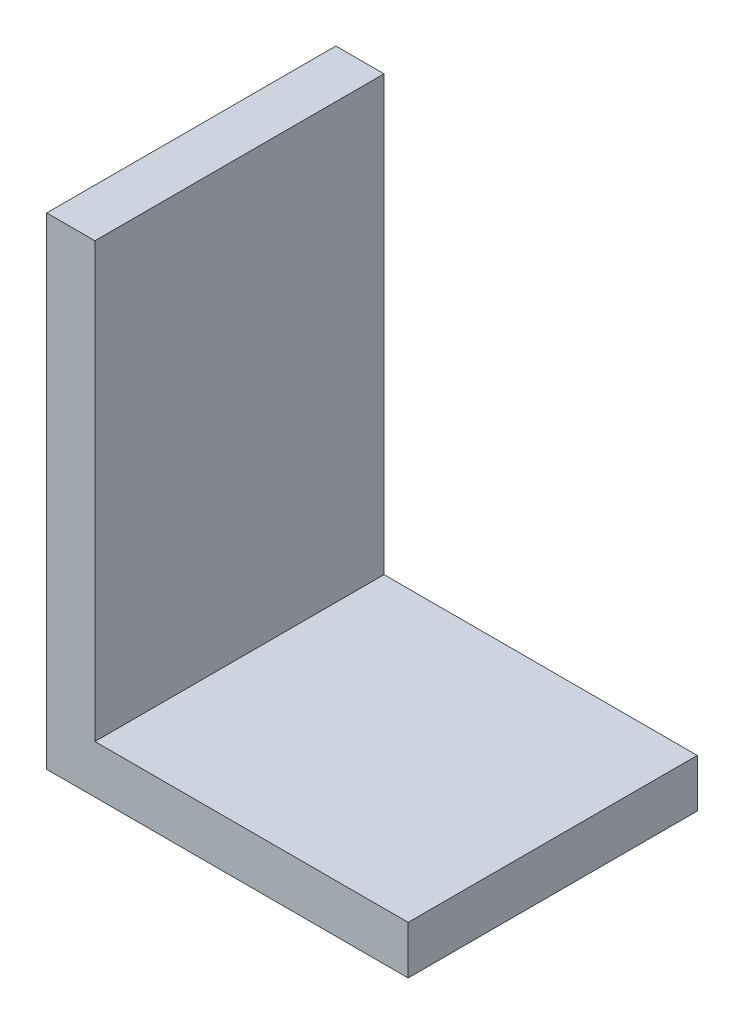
from build123d import *

# Parameters (mm, degrees)
EXTRUDE_THIN1_DEPTH = 30


with BuildPart() as part:
    # Sketch1 → Extrude-Thin1 (new, symmetric)
    with BuildSketch(Plane.XY):
        Polygon((0, 100), (0, 0), (75, 0), (75, 10), (10, 10), (10, 100), align=None)
    extrude(amount=EXTRUDE_THIN1_DEPTH, both=True)


solid = part.part
